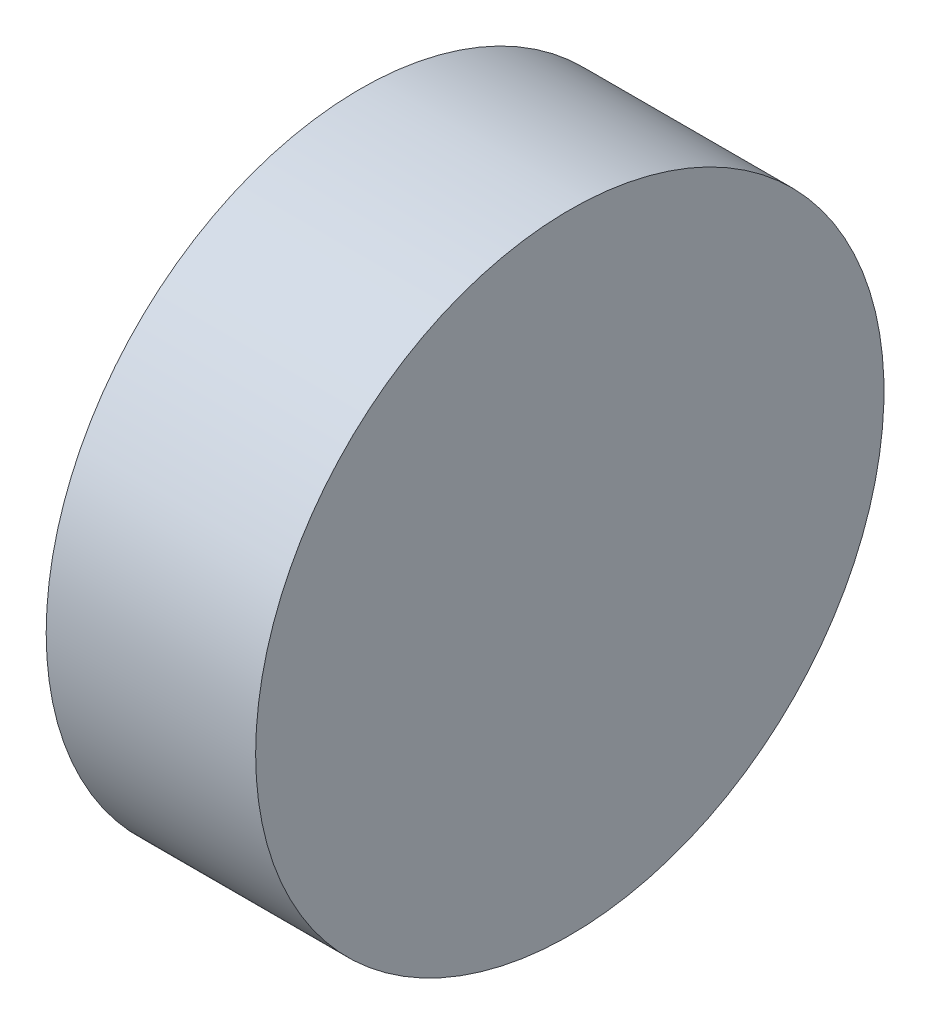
ISO-10303-21;
HEADER;
FILE_DESCRIPTION(('STEP AP214'),'2;1');
FILE_NAME('part.step','',(''),(''),'','','');
FILE_SCHEMA(('AUTOMOTIVE_DESIGN { 1 0 10303 214 1 1 1 1 }'));
ENDSEC;
DATA;
#1=APPLICATION_CONTEXT('core data for automotive mechanical design processes');
#2=APPLICATION_PROTOCOL_DEFINITION('international standard','automotive_design',2000,#1);
#3=PRODUCT_CONTEXT('',#1,'mechanical');
#4=PRODUCT('Part','Part','',(#3));
#5=PRODUCT_RELATED_PRODUCT_CATEGORY('part','',(#4));
#6=PRODUCT_DEFINITION_FORMATION('','',#4);
#7=PRODUCT_DEFINITION_CONTEXT('part definition',#1,'design');
#8=PRODUCT_DEFINITION('design','',#6,#7);
#9=PRODUCT_DEFINITION_SHAPE('','',#8);
#10=(LENGTH_UNIT() NAMED_UNIT(*) SI_UNIT(.MILLI.,.METRE.));
#11=(NAMED_UNIT(*) PLANE_ANGLE_UNIT() SI_UNIT($,.RADIAN.));
#12=(NAMED_UNIT(*) SI_UNIT($,.STERADIAN.) SOLID_ANGLE_UNIT());
#13=UNCERTAINTY_MEASURE_WITH_UNIT(LENGTH_MEASURE(1.E-05),#10,'distance_accuracy_value','');
#14=(GEOMETRIC_REPRESENTATION_CONTEXT(3) GLOBAL_UNCERTAINTY_ASSIGNED_CONTEXT((#13)) GLOBAL_UNIT_ASSIGNED_CONTEXT((#10,
#11,#12)) REPRESENTATION_CONTEXT('',''));
#15=CARTESIAN_POINT('',(0.,0.,0.));
#16=DIRECTION('',(0.,0.,1.));
#17=DIRECTION('',(1.,0.,0.));
#18=AXIS2_PLACEMENT_3D('',#15,#16,#17);
#19=CARTESIAN_POINT('',(100.,0.,0.));
#20=DIRECTION('',(-1.,0.,0.));
#21=DIRECTION('',(0.,0.,1.));
#22=AXIS2_PLACEMENT_3D('',#19,#20,#21);
#23=CYLINDRICAL_SURFACE('',#22,150.);
#24=CARTESIAN_POINT('',(100.,0.,0.));
#25=DIRECTION('',(1.,0.,0.));
#26=DIRECTION('',(0.,0.,-1.));
#27=AXIS2_PLACEMENT_3D('',#24,#25,#26);
#28=CIRCLE('',#27,150.);
#29=CARTESIAN_POINT('',(100.,0.,150.));
#30=VERTEX_POINT('',#29);
#31=EDGE_CURVE('E10',#30,#30,#28,.T.);
#32=CARTESIAN_POINT('',(0.,0.,0.));
#33=DIRECTION('',(1.,0.,0.));
#34=DIRECTION('',(0.,0.,-1.));
#35=AXIS2_PLACEMENT_3D('',#32,#33,#34);
#36=CIRCLE('',#35,150.);
#37=CARTESIAN_POINT('',(0.,0.,150.));
#38=VERTEX_POINT('',#37);
#39=EDGE_CURVE('E35',#38,#38,#36,.T.);
#40=CARTESIAN_POINT('',(100.,0.,150.));
#41=CARTESIAN_POINT('',(98.9583333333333,0.,150.));
#42=CARTESIAN_POINT('',(97.9166666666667,0.,150.));
#43=CARTESIAN_POINT('',(95.8333333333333,0.,150.));
#44=CARTESIAN_POINT('',(94.7916666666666,0.,150.));
#45=CARTESIAN_POINT('',(92.7083333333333,0.,150.));
#46=CARTESIAN_POINT('',(91.6666666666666,0.,150.));
#47=CARTESIAN_POINT('',(89.5833333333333,0.,150.));
#48=CARTESIAN_POINT('',(88.5416666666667,0.,150.));
#49=CARTESIAN_POINT('',(86.4583333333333,0.,150.));
#50=CARTESIAN_POINT('',(85.4166666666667,0.,150.));
#51=CARTESIAN_POINT('',(83.3333333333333,0.,150.));
#52=CARTESIAN_POINT('',(82.2916666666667,0.,150.));
#53=CARTESIAN_POINT('',(80.2083333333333,0.,150.));
#54=CARTESIAN_POINT('',(79.1666666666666,0.,150.));
#55=CARTESIAN_POINT('',(77.0833333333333,0.,150.));
#56=CARTESIAN_POINT('',(76.0416666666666,0.,150.));
#57=CARTESIAN_POINT('',(73.9583333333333,0.,150.));
#58=CARTESIAN_POINT('',(72.9166666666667,0.,150.));
#59=CARTESIAN_POINT('',(70.8333333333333,0.,150.));
#60=CARTESIAN_POINT('',(69.7916666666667,0.,150.));
#61=CARTESIAN_POINT('',(67.7083333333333,0.,150.));
#62=CARTESIAN_POINT('',(66.6666666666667,0.,150.));
#63=CARTESIAN_POINT('',(64.5833333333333,0.,150.));
#64=CARTESIAN_POINT('',(63.5416666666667,0.,150.));
#65=CARTESIAN_POINT('',(61.4583333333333,0.,150.));
#66=CARTESIAN_POINT('',(60.4166666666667,0.,150.));
#67=CARTESIAN_POINT('',(58.3333333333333,0.,150.));
#68=CARTESIAN_POINT('',(57.2916666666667,0.,150.));
#69=CARTESIAN_POINT('',(55.2083333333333,0.,150.));
#70=CARTESIAN_POINT('',(54.1666666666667,0.,150.));
#71=CARTESIAN_POINT('',(52.0833333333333,0.,150.));
#72=CARTESIAN_POINT('',(51.0416666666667,0.,150.));
#73=CARTESIAN_POINT('',(48.9583333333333,0.,150.));
#74=CARTESIAN_POINT('',(47.9166666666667,0.,150.));
#75=CARTESIAN_POINT('',(45.8333333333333,0.,150.));
#76=CARTESIAN_POINT('',(44.7916666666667,0.,150.));
#77=CARTESIAN_POINT('',(42.7083333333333,0.,150.));
#78=CARTESIAN_POINT('',(41.6666666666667,0.,150.));
#79=CARTESIAN_POINT('',(39.5833333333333,0.,150.));
#80=CARTESIAN_POINT('',(38.5416666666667,0.,150.));
#81=CARTESIAN_POINT('',(36.4583333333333,0.,150.));
#82=CARTESIAN_POINT('',(35.4166666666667,0.,150.));
#83=CARTESIAN_POINT('',(33.3333333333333,0.,150.));
#84=CARTESIAN_POINT('',(32.2916666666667,0.,150.));
#85=CARTESIAN_POINT('',(30.2083333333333,0.,150.));
#86=CARTESIAN_POINT('',(29.1666666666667,0.,150.));
#87=CARTESIAN_POINT('',(27.0833333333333,0.,150.));
#88=CARTESIAN_POINT('',(26.0416666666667,0.,150.));
#89=CARTESIAN_POINT('',(23.9583333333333,0.,150.));
#90=CARTESIAN_POINT('',(22.9166666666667,0.,150.));
#91=CARTESIAN_POINT('',(20.8333333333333,0.,150.));
#92=CARTESIAN_POINT('',(19.7916666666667,0.,150.));
#93=CARTESIAN_POINT('',(17.7083333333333,0.,150.));
#94=CARTESIAN_POINT('',(16.6666666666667,0.,150.));
#95=CARTESIAN_POINT('',(14.5833333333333,0.,150.));
#96=CARTESIAN_POINT('',(13.5416666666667,0.,150.));
#97=CARTESIAN_POINT('',(11.4583333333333,0.,150.));
#98=CARTESIAN_POINT('',(10.4166666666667,0.,150.));
#99=CARTESIAN_POINT('',(8.33333333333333,0.,150.));
#100=CARTESIAN_POINT('',(7.29166666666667,0.,150.));
#101=CARTESIAN_POINT('',(5.20833333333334,0.,150.));
#102=CARTESIAN_POINT('',(4.16666666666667,0.,150.));
#103=CARTESIAN_POINT('',(2.08333333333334,0.,150.));
#104=CARTESIAN_POINT('',(1.04166666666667,0.,150.));
#105=CARTESIAN_POINT('',(0.,0.,150.));
#106=B_SPLINE_CURVE_WITH_KNOTS('',3,(#40,#41,#42,#43,#44,#45,#46,#47,#48,#49,#50,#51,#52,#53,
#54,#55,#56,#57,#58,#59,#60,#61,#62,#63,#64,#65,#66,#67,#68,#69,#70,#71,#72,#73,#74,#75,#76,#77,
#78,#79,#80,#81,#82,#83,#84,#85,#86,#87,#88,#89,#90,#91,#92,#93,#94,#95,#96,#97,#98,#99,#100,
#101,#102,#103,#104,#105),.UNSPECIFIED.,.F.,.F.,(4,2,2,2,2,2,2,2,2,2,2,2,2,2,2,2,2,2,2,2,2,2,2,
2,2,2,2,2,2,2,2,2,4),(0.,3.12499999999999,6.24999999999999,9.37499999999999,12.5,15.625,18.75,
21.875,25.,28.125,31.25,34.375,37.5,40.625,43.75,46.875,50.,53.125,56.25,59.375,62.5,65.625,
68.75,71.875,75.,78.125,81.25,84.375,87.5,90.625,93.75,96.875,100.),.UNSPECIFIED.);
#107=EDGE_CURVE('BSEAM32',#30,#38,#106,.T.);
#108=ORIENTED_EDGE('',*,*,#31,.F.);
#109=ORIENTED_EDGE('',*,*,#39,.T.);
#110=ORIENTED_EDGE('',*,*,#107,.T.);
#111=ORIENTED_EDGE('',*,*,#107,.F.);
#112=EDGE_LOOP('',(#108,#110,#109,#111));
#113=FACE_BOUND('',#112,.T.);
#114=ADVANCED_FACE('F32',(#113),#23,.T.);
#115=CARTESIAN_POINT('',(100.,0.,0.));
#116=DIRECTION('',(1.,0.,0.));
#117=DIRECTION('',(0.,0.,-1.));
#118=AXIS2_PLACEMENT_3D('',#115,#116,#117);
#119=PLANE('',#118);
#120=ORIENTED_EDGE('',*,*,#31,.T.);
#121=EDGE_LOOP('',(#120));
#122=FACE_BOUND('',#121,.T.);
#123=ADVANCED_FACE('F47',(#122),#119,.T.);
#124=CARTESIAN_POINT('',(0.,0.,0.));
#125=DIRECTION('',(1.,0.,0.));
#126=DIRECTION('',(0.,0.,-1.));
#127=AXIS2_PLACEMENT_3D('',#124,#125,#126);
#128=PLANE('',#127);
#129=ORIENTED_EDGE('',*,*,#39,.F.);
#130=EDGE_LOOP('',(#129));
#131=FACE_BOUND('',#130,.T.);
#132=ADVANCED_FACE('F45',(#131),#128,.F.);
#133=CLOSED_SHELL('',(#114,#123,#132));
#134=MANIFOLD_SOLID_BREP('B2',#133);
#135=ADVANCED_BREP_SHAPE_REPRESENTATION('',(#18,#134),#14);
#136=SHAPE_DEFINITION_REPRESENTATION(#9,#135);
ENDSEC;
END-ISO-10303-21;
